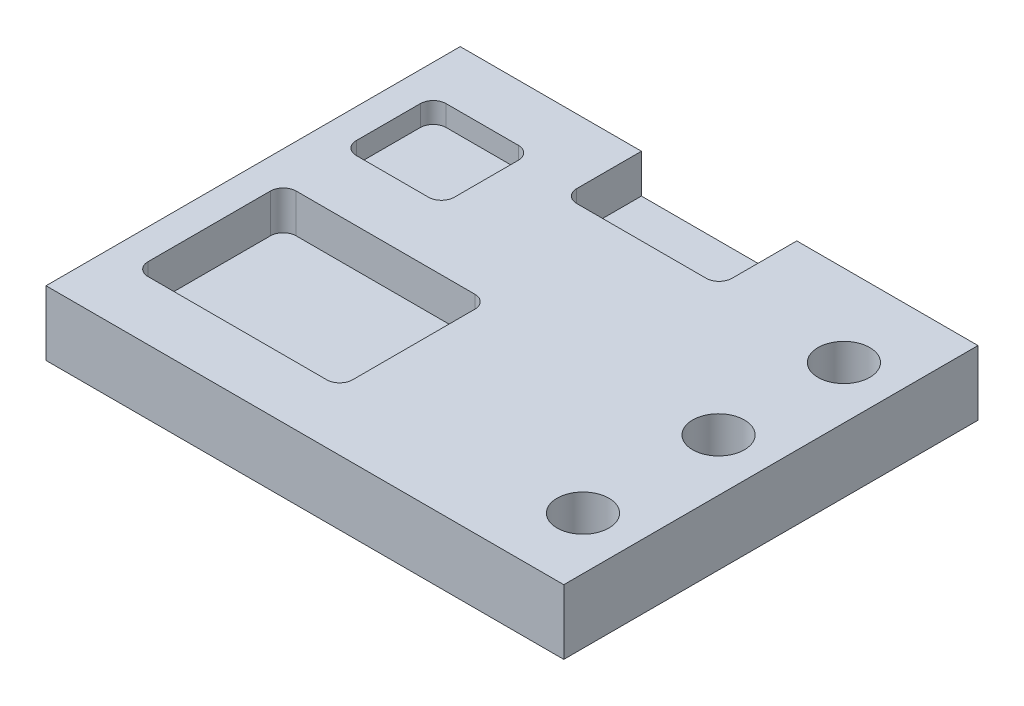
from build123d import *

# Parameters (mm, degrees)
SKETCH1_W          = 127
SKETCH1_H          = 101.6
EXTRUDE1_DEPTH     = 15.875
SKETCH2_W          = 24.058704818
SKETCH2_H          = 22.045456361
SMALL_POCKET_DEPTH = 5.08
SKETCH3_W          = 50.179267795
SKETCH3_H          = 36.345093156
LARGE_POCKET_DEPTH = 9.525
SKETCH5_W          = 38.1
SKETCH5_H          = 19.05
SLOT_DEPTH         = 9.525
FILLET1_R          = 3.175
SKETCH4_R          = 6.35
HOLE_1_DEPTH       = 83.854726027
SKETCH6_R          = 6.35
HOLE_2_DEPTH       = 83.854726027
SKETCH7_R          = 6.35
HOLE_3_DEPTH       = 83.854726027


with BuildPart() as part:
    # Sketch1 → Extrude1 (new body)
    with BuildSketch(Plane(origin=(0, 0, 0), x_dir=(1, 0, 0), z_dir=(0, 1, 0))):
        Rectangle(SKETCH1_W, SKETCH1_H)
    extrude(amount=EXTRUDE1_DEPTH)

    # Sketch2 → Small Pocket (cut)
    with BuildSketch(Plane(origin=(0, 15.875, 0), x_dir=(-1, 0, 0), z_dir=(0, 1, 0))):
        with Locations((44.253591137, -25.936942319)):
            Rectangle(SKETCH2_W, SKETCH2_H)
    extrude(amount=-SMALL_POCKET_DEPTH, mode=Mode.SUBTRACT)

    # Sketch3 → Large Pocket (cut)
    with BuildSketch(Plane(origin=(0, 15.875, 0), x_dir=(-1, 0, 0), z_dir=(0, 1, 0))):
        with Locations((31.010571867, 18.172546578)):
            Rectangle(SKETCH3_W, SKETCH3_H)
    extrude(amount=-LARGE_POCKET_DEPTH, mode=Mode.SUBTRACT)

    # Sketch5 → Slot (cut)
    with BuildSketch(Plane(origin=(0, 15.875, 0), x_dir=(-1, 0, 0), z_dir=(0, 1, 0))):
        with Locations((0, -41.275)):
            Rectangle(SKETCH5_W, SKETCH5_H)
    extrude(amount=-SLOT_DEPTH, mode=Mode.SUBTRACT)

    # Fillet1
    fillet1_edges = [part.edges().sort_by_distance(p)[0] for p in [
        (-56.282943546, 13.335, -14.914214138),
        (-56.282943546, 13.335, -36.959670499),
        (-32.224238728, 13.335, -36.959670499),
        (-32.224238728, 13.335, -14.914214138),
        (-56.100205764, 11.1125, 36.345093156),
        (-56.100205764, 11.1125, 0),
        (-5.920937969, 11.1125, 0),
        (-5.920937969, 11.1125, 36.345093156),
        (19.05, 11.1125, -31.75),
        (-19.05, 11.1125, -31.75),
    ]]
    fillet(fillet1_edges, radius=FILLET1_R)

    # Sketch4 → Hole 1 (cut, through all)
    with BuildSketch(Plane(origin=(0, 15.875, 0), x_dir=(-1, 0, 0), z_dir=(0, 1, 0))):
        with Locations(Location((-50.655270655, -30.754985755, 0), (0, 0, 90))):
            Circle(SKETCH4_R)
    extrude(amount=-HOLE_1_DEPTH, mode=Mode.SUBTRACT)

    # Sketch6 → Hole 2 (cut, through all)
    with BuildSketch(Plane(origin=(0, 15.875, 0), x_dir=(-1, 0, 0), z_dir=(0, 1, 0))):
        with Locations(Location((-50.655270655, 0, 0), (0, 0, 90))):
            Circle(SKETCH6_R)
    extrude(amount=-HOLE_2_DEPTH, mode=Mode.SUBTRACT)

    # Sketch7 → Hole 3 (cut, through all)
    with BuildSketch(Plane(origin=(0, 15.875, 0), x_dir=(-1, 0, 0), z_dir=(0, 1, 0))):
        with Locations(Location((-50.655270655, 33.242521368, 0), (0, 0, 90))):
            Circle(SKETCH7_R)
    extrude(amount=-HOLE_3_DEPTH, mode=Mode.SUBTRACT)


solid = part.part
